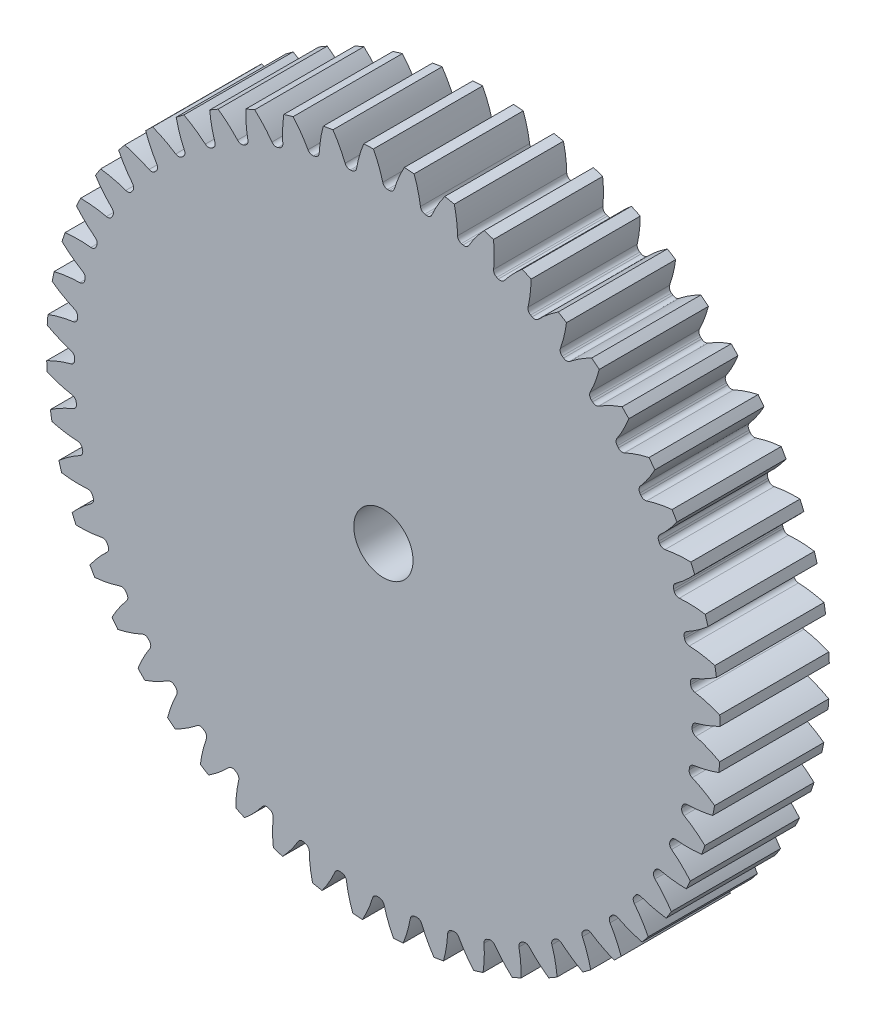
from build123d import *

# Parameters (mm, degrees)
SKETCH3_R         = 274.32
GEARBODY_DEPTH    = 88.9
TOOTHCUT_DEPTH    = 399.002681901
CIRPATTERN1_COUNT = 52
BOREDIA_R         = 24.13
BORE_DEPTH        = 12700


with BuildPart() as part:
    # Sketch3 → gearBody (new body)
    with BuildSketch(Plane.XY):
        Circle(SKETCH3_R)
    extrude(amount=GEARBODY_DEPTH)

    # Sketch2 → toothCut (cut, through all)
    with BuildSketch(Plane.XY):
        with BuildLine():
            ThreePointArc((251.41418734, -4.799792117), (251.426484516, -4.105421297), (251.436863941, -3.411019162))
            ThreePointArc((251.436863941, -3.411019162), (252.309883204, -0.925380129), (254.506833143, 0.528571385))
            ThreePointArc((254.506833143, 0.528571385), (264.622362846, 3.823212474), (274.32, 8.197504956))
            ThreePointArc((274.32, 8.197504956), (274.405877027, -4.480640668), (273.906125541, -17.149223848))
            ThreePointArc((273.906125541, -17.149223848), (264.356471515, -12.460651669), (254.353898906, -8.837511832))
            ThreePointArc((254.353898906, -8.837511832), (252.205589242, -7.312608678), (251.41418734, -4.799792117))
        make_face()
    toothcut = extrude(amount=TOOTHCUT_DEPTH, mode=Mode.SUBTRACT)

    # CirPattern1: toothCut ×52 about axis
    cirpattern1_axis = Axis((0, 0, 0), (0, 0, 1))
    for i in range(1, CIRPATTERN1_COUNT):
        add(toothcut.rotate(cirpattern1_axis, i * 360 / CIRPATTERN1_COUNT), mode=Mode.SUBTRACT)

    # boreDia → bore (cut, symmetric)
    with BuildSketch(Plane.XY):
        Circle(BOREDIA_R)
    extrude(amount=BORE_DEPTH, both=True, mode=Mode.SUBTRACT)


solid = part.part
